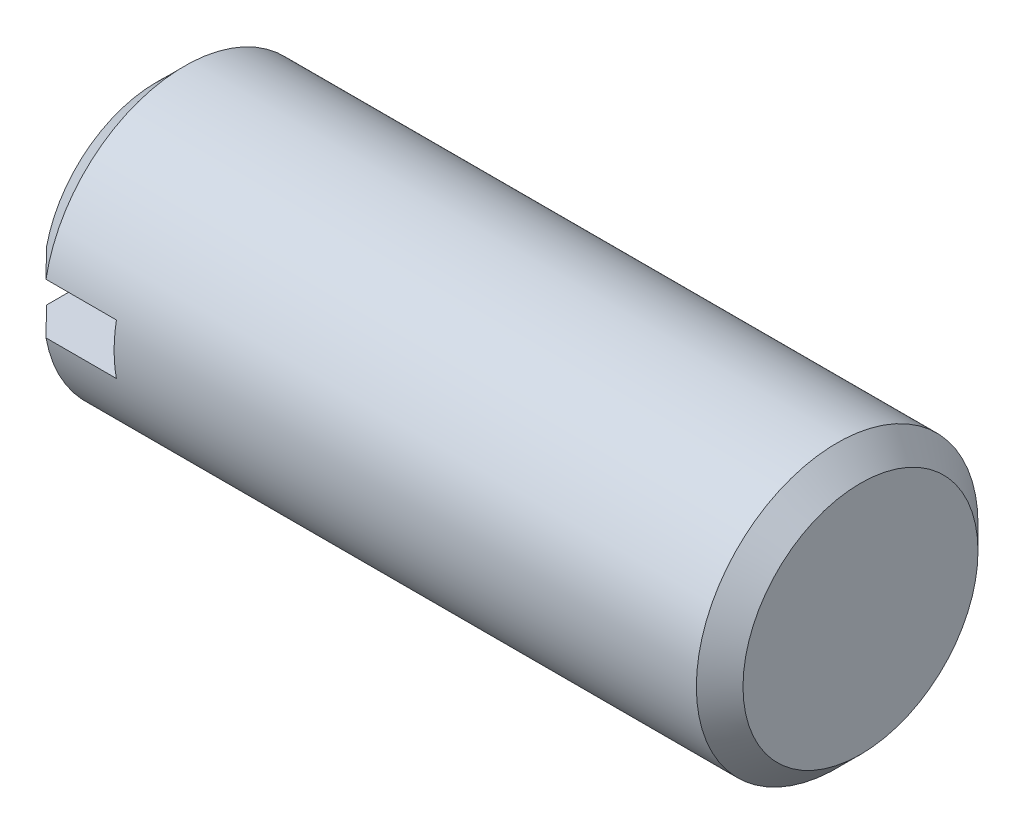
from build123d import *

# Parameters (mm, degrees)
SLOT_DEPTH      = 26.980762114
SLOT_DEPTH_BACK = 26.980762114
SLOTSKE_W       = 3.5
SLOTSKE_H       = 1.8


with BuildPart() as part:
    # BodySke → Base-Revolve (revolve)
    with BuildSketch(Plane.XY, mode=Mode.PRIVATE) as base_revolve_sk:
        Polygon((0, 0), (0, 4), (1, 5), (24.172, 5), (25, 4.172), (25, 0), align=None)
    revolve(base_revolve_sk.sketch.rotate(Axis((-3.67611336, 0, 0), (1, 0, 0)), 90), axis=Axis((-3.67611336, 0, 0), (1, 0, 0)))

    # SlotSke → Slot (cut, two sides: drawn at the far end of the back side and taken through both)
    with BuildSketch(Plane.XY.offset(-SLOT_DEPTH_BACK)):
        with Locations((1.75, 0)):
            Rectangle(SLOTSKE_W, SLOTSKE_H)
    extrude(amount=SLOT_DEPTH + SLOT_DEPTH_BACK, mode=Mode.SUBTRACT)


solid = part.part
